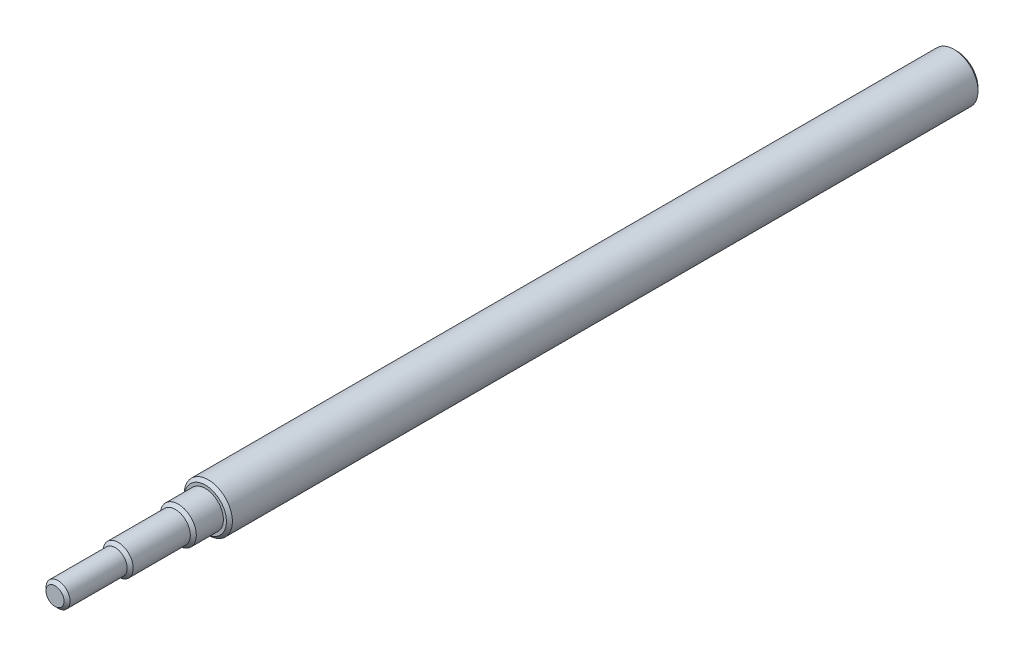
ISO-10303-21;
HEADER;
FILE_DESCRIPTION(('STEP AP214'),'2;1');
FILE_NAME('part.step','',(''),(''),'','','');
FILE_SCHEMA(('AUTOMOTIVE_DESIGN { 1 0 10303 214 1 1 1 1 }'));
ENDSEC;
DATA;
#1=APPLICATION_CONTEXT('core data for automotive mechanical design processes');
#2=APPLICATION_PROTOCOL_DEFINITION('international standard','automotive_design',2000,#1);
#3=PRODUCT_CONTEXT('',#1,'mechanical');
#4=PRODUCT('Part','Part','',(#3));
#5=PRODUCT_RELATED_PRODUCT_CATEGORY('part','',(#4));
#6=PRODUCT_DEFINITION_FORMATION('','',#4);
#7=PRODUCT_DEFINITION_CONTEXT('part definition',#1,'design');
#8=PRODUCT_DEFINITION('design','',#6,#7);
#9=PRODUCT_DEFINITION_SHAPE('','',#8);
#10=(LENGTH_UNIT() NAMED_UNIT(*) SI_UNIT(.MILLI.,.METRE.));
#11=(NAMED_UNIT(*) PLANE_ANGLE_UNIT() SI_UNIT($,.RADIAN.));
#12=(NAMED_UNIT(*) SI_UNIT($,.STERADIAN.) SOLID_ANGLE_UNIT());
#13=UNCERTAINTY_MEASURE_WITH_UNIT(LENGTH_MEASURE(1.E-05),#10,'distance_accuracy_value','');
#14=(GEOMETRIC_REPRESENTATION_CONTEXT(3) GLOBAL_UNCERTAINTY_ASSIGNED_CONTEXT((#13)) GLOBAL_UNIT_ASSIGNED_CONTEXT((#10,
#11,#12)) REPRESENTATION_CONTEXT('',''));
#15=CARTESIAN_POINT('',(0.,0.,0.));
#16=DIRECTION('',(0.,0.,1.));
#17=DIRECTION('',(1.,0.,0.));
#18=AXIS2_PLACEMENT_3D('',#15,#16,#17);
#19=CARTESIAN_POINT('',(0.,0.,250.));
#20=DIRECTION('',(0.,0.,-1.));
#21=DIRECTION('',(-1.,0.,0.));
#22=AXIS2_PLACEMENT_3D('',#19,#20,#21);
#23=CYLINDRICAL_SURFACE('',#22,8.);
#24=CARTESIAN_POINT('',(0.,0.,249.));
#25=DIRECTION('',(0.,0.,1.));
#26=DIRECTION('',(1.,0.,0.));
#27=AXIS2_PLACEMENT_3D('',#24,#25,#26);
#28=CIRCLE('',#27,8.);
#29=CARTESIAN_POINT('',(8.,0.,249.));
#30=VERTEX_POINT('',#29);
#31=EDGE_CURVE('E55',#30,#30,#28,.F.);
#32=ORIENTED_EDGE('',*,*,#31,.T.);
#33=EDGE_LOOP('',(#32));
#34=FACE_BOUND('',#33,.T.);
#35=CARTESIAN_POINT('',(0.,0.,0.999999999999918));
#36=DIRECTION('',(0.,0.,1.));
#37=DIRECTION('',(1.,0.,0.));
#38=AXIS2_PLACEMENT_3D('',#35,#36,#37);
#39=CIRCLE('',#38,8.);
#40=CARTESIAN_POINT('',(8.,0.,0.999999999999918));
#41=VERTEX_POINT('',#40);
#42=EDGE_CURVE('E64',#41,#41,#39,.T.);
#43=ORIENTED_EDGE('',*,*,#42,.T.);
#44=EDGE_LOOP('',(#43));
#45=FACE_BOUND('',#44,.T.);
#46=ADVANCED_FACE('F35',(#34,#45),#23,.T.);
#47=CARTESIAN_POINT('',(0.,0.,250.));
#48=DIRECTION('',(0.,0.,1.));
#49=DIRECTION('',(1.,0.,0.));
#50=AXIS2_PLACEMENT_3D('',#47,#48,#49);
#51=PLANE('',#50);
#52=CARTESIAN_POINT('',(0.,0.,250.));
#53=DIRECTION('',(0.,0.,1.));
#54=DIRECTION('',(1.,0.,0.));
#55=AXIS2_PLACEMENT_3D('',#52,#53,#54);
#56=CIRCLE('',#55,7.00000000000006);
#57=CARTESIAN_POINT('',(7.00000000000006,0.,250.));
#58=VERTEX_POINT('',#57);
#59=EDGE_CURVE('E58',#58,#58,#56,.T.);
#60=ORIENTED_EDGE('',*,*,#59,.T.);
#61=EDGE_LOOP('',(#60));
#62=FACE_BOUND('',#61,.T.);
#63=CARTESIAN_POINT('',(0.,0.,250.));
#64=DIRECTION('',(0.,0.,1.));
#65=DIRECTION('',(1.,0.,0.));
#66=AXIS2_PLACEMENT_3D('',#63,#64,#65);
#67=CIRCLE('',#66,6.);
#68=CARTESIAN_POINT('',(6.,0.,250.));
#69=VERTEX_POINT('',#68);
#70=EDGE_CURVE('E67',#69,#69,#67,.T.);
#71=ORIENTED_EDGE('',*,*,#70,.F.);
#72=EDGE_LOOP('',(#71));
#73=FACE_BOUND('',#72,.T.);
#74=ADVANCED_FACE('F92',(#62,#73),#51,.T.);
#75=CARTESIAN_POINT('',(0.,0.,0.));
#76=DIRECTION('',(0.,0.,1.));
#77=DIRECTION('',(1.,0.,0.));
#78=AXIS2_PLACEMENT_3D('',#75,#76,#77);
#79=PLANE('',#78);
#80=CARTESIAN_POINT('',(0.,0.,0.));
#81=DIRECTION('',(0.,0.,1.));
#82=DIRECTION('',(1.,0.,0.));
#83=AXIS2_PLACEMENT_3D('',#80,#81,#82);
#84=CIRCLE('',#83,7.00000000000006);
#85=CARTESIAN_POINT('',(7.00000000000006,0.,0.));
#86=VERTEX_POINT('',#85);
#87=EDGE_CURVE('E61',#86,#86,#84,.F.);
#88=ORIENTED_EDGE('',*,*,#87,.T.);
#89=EDGE_LOOP('',(#88));
#90=FACE_BOUND('',#89,.T.);
#91=ADVANCED_FACE('F98',(#90),#79,.F.);
#92=CARTESIAN_POINT('',(0.,0.,260.));
#93=DIRECTION('',(0.,0.,-1.));
#94=DIRECTION('',(-1.,0.,0.));
#95=AXIS2_PLACEMENT_3D('',#92,#93,#94);
#96=CYLINDRICAL_SURFACE('',#95,6.);
#97=CARTESIAN_POINT('',(0.,0.,259.));
#98=DIRECTION('',(0.,0.,1.));
#99=DIRECTION('',(1.,0.,0.));
#100=AXIS2_PLACEMENT_3D('',#97,#98,#99);
#101=CIRCLE('',#100,6.);
#102=CARTESIAN_POINT('',(6.,0.,259.));
#103=VERTEX_POINT('',#102);
#104=EDGE_CURVE('E10',#103,#103,#101,.F.);
#105=ORIENTED_EDGE('',*,*,#104,.T.);
#106=EDGE_LOOP('',(#105));
#107=FACE_BOUND('',#106,.T.);
#108=ORIENTED_EDGE('',*,*,#70,.T.);
#109=EDGE_LOOP('',(#108));
#110=FACE_BOUND('',#109,.T.);
#111=ADVANCED_FACE('F119',(#107,#110),#96,.T.);
#112=CARTESIAN_POINT('',(0.,0.,280.));
#113=DIRECTION('',(0.,0.,-1.));
#114=DIRECTION('',(-1.,0.,0.));
#115=AXIS2_PLACEMENT_3D('',#112,#113,#114);
#116=CYLINDRICAL_SURFACE('',#115,5.);
#117=CARTESIAN_POINT('',(0.,0.,279.));
#118=DIRECTION('',(0.,0.,1.));
#119=DIRECTION('',(1.,0.,0.));
#120=AXIS2_PLACEMENT_3D('',#117,#118,#119);
#121=CIRCLE('',#120,5.);
#122=CARTESIAN_POINT('',(5.,0.,279.));
#123=VERTEX_POINT('',#122);
#124=EDGE_CURVE('E42',#123,#123,#121,.F.);
#125=ORIENTED_EDGE('',*,*,#124,.T.);
#126=EDGE_LOOP('',(#125));
#127=FACE_BOUND('',#126,.T.);
#128=CARTESIAN_POINT('',(0.,0.,260.));
#129=DIRECTION('',(0.,0.,1.));
#130=DIRECTION('',(1.,0.,0.));
#131=AXIS2_PLACEMENT_3D('',#128,#129,#130);
#132=CIRCLE('',#131,5.);
#133=CARTESIAN_POINT('',(5.,0.,260.));
#134=VERTEX_POINT('',#133);
#135=EDGE_CURVE('E70',#134,#134,#132,.T.);
#136=ORIENTED_EDGE('',*,*,#135,.T.);
#137=EDGE_LOOP('',(#136));
#138=FACE_BOUND('',#137,.T.);
#139=ADVANCED_FACE('F121',(#127,#138),#116,.T.);
#140=CARTESIAN_POINT('',(0.,0.,300.));
#141=DIRECTION('',(0.,0.,-1.));
#142=DIRECTION('',(-1.,0.,0.));
#143=AXIS2_PLACEMENT_3D('',#140,#141,#142);
#144=CYLINDRICAL_SURFACE('',#143,4.);
#145=CARTESIAN_POINT('',(0.,0.,299.));
#146=DIRECTION('',(0.,0.,1.));
#147=DIRECTION('',(1.,0.,0.));
#148=AXIS2_PLACEMENT_3D('',#145,#146,#147);
#149=CIRCLE('',#148,4.);
#150=CARTESIAN_POINT('',(4.,0.,299.));
#151=VERTEX_POINT('',#150);
#152=EDGE_CURVE('E46',#151,#151,#149,.F.);
#153=ORIENTED_EDGE('',*,*,#152,.T.);
#154=EDGE_LOOP('',(#153));
#155=FACE_BOUND('',#154,.T.);
#156=CARTESIAN_POINT('',(0.,0.,280.));
#157=DIRECTION('',(0.,0.,1.));
#158=DIRECTION('',(1.,0.,0.));
#159=AXIS2_PLACEMENT_3D('',#156,#157,#158);
#160=CIRCLE('',#159,4.);
#161=CARTESIAN_POINT('',(4.,0.,280.));
#162=VERTEX_POINT('',#161);
#163=EDGE_CURVE('E73',#162,#162,#160,.T.);
#164=ORIENTED_EDGE('',*,*,#163,.T.);
#165=EDGE_LOOP('',(#164));
#166=FACE_BOUND('',#165,.T.);
#167=ADVANCED_FACE('F77',(#155,#166),#144,.T.);
#168=CARTESIAN_POINT('',(0.,0.,300.));
#169=DIRECTION('',(0.,0.,1.));
#170=DIRECTION('',(1.,0.,0.));
#171=AXIS2_PLACEMENT_3D('',#168,#169,#170);
#172=PLANE('',#171);
#173=CARTESIAN_POINT('',(0.,0.,300.));
#174=DIRECTION('',(0.,0.,1.));
#175=DIRECTION('',(1.,0.,0.));
#176=AXIS2_PLACEMENT_3D('',#173,#174,#175);
#177=CIRCLE('',#176,3.00000000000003);
#178=CARTESIAN_POINT('',(3.00000000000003,0.,300.));
#179=VERTEX_POINT('',#178);
#180=EDGE_CURVE('E50',#179,#179,#177,.T.);
#181=ORIENTED_EDGE('',*,*,#180,.T.);
#182=EDGE_LOOP('',(#181));
#183=FACE_BOUND('',#182,.T.);
#184=ADVANCED_FACE('F107',(#183),#172,.T.);
#185=CARTESIAN_POINT('',(0.,0.,0.999999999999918));
#186=DIRECTION('',(0.,0.,1.));
#187=DIRECTION('',(1.,0.,0.));
#188=AXIS2_PLACEMENT_3D('',#185,#186,#187);
#189=CONICAL_SURFACE('',#188,8.,0.785398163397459);
#190=ORIENTED_EDGE('',*,*,#87,.F.);
#191=EDGE_LOOP('',(#190));
#192=FACE_BOUND('',#191,.T.);
#193=ORIENTED_EDGE('',*,*,#42,.F.);
#194=EDGE_LOOP('',(#193));
#195=FACE_BOUND('',#194,.T.);
#196=ADVANCED_FACE('F104',(#192,#195),#189,.T.);
#197=CARTESIAN_POINT('',(0.,0.,250.));
#198=DIRECTION('',(0.,0.,-1.));
#199=DIRECTION('',(-1.,0.,0.));
#200=AXIS2_PLACEMENT_3D('',#197,#198,#199);
#201=CONICAL_SURFACE('',#200,7.00000000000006,0.785398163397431);
#202=ORIENTED_EDGE('',*,*,#31,.F.);
#203=EDGE_LOOP('',(#202));
#204=FACE_BOUND('',#203,.T.);
#205=ORIENTED_EDGE('',*,*,#59,.F.);
#206=EDGE_LOOP('',(#205));
#207=FACE_BOUND('',#206,.T.);
#208=ADVANCED_FACE('F88',(#204,#207),#201,.T.);
#209=CARTESIAN_POINT('',(0.,0.,300.));
#210=DIRECTION('',(0.,0.,-1.));
#211=DIRECTION('',(-1.,0.,0.));
#212=AXIS2_PLACEMENT_3D('',#209,#210,#211);
#213=CONICAL_SURFACE('',#212,3.00000000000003,0.785398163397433);
#214=ORIENTED_EDGE('',*,*,#152,.F.);
#215=EDGE_LOOP('',(#214));
#216=FACE_BOUND('',#215,.T.);
#217=ORIENTED_EDGE('',*,*,#180,.F.);
#218=EDGE_LOOP('',(#217));
#219=FACE_BOUND('',#218,.T.);
#220=ADVANCED_FACE('F81',(#216,#219),#213,.T.);
#221=CARTESIAN_POINT('',(0.,0.,280.));
#222=DIRECTION('',(0.,0.,-1.));
#223=DIRECTION('',(-1.,0.,0.));
#224=AXIS2_PLACEMENT_3D('',#221,#222,#223);
#225=CONICAL_SURFACE('',#224,3.99999999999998,0.78539816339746);
#226=ORIENTED_EDGE('',*,*,#124,.F.);
#227=EDGE_LOOP('',(#226));
#228=FACE_BOUND('',#227,.T.);
#229=ORIENTED_EDGE('',*,*,#163,.F.);
#230=EDGE_LOOP('',(#229));
#231=FACE_BOUND('',#230,.T.);
#232=ADVANCED_FACE('F79',(#228,#231),#225,.T.);
#233=CARTESIAN_POINT('',(0.,0.,260.));
#234=DIRECTION('',(0.,0.,-1.));
#235=DIRECTION('',(-1.,0.,0.));
#236=AXIS2_PLACEMENT_3D('',#233,#234,#235);
#237=CONICAL_SURFACE('',#236,4.99999999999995,0.785398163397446);
#238=ORIENTED_EDGE('',*,*,#104,.F.);
#239=EDGE_LOOP('',(#238));
#240=FACE_BOUND('',#239,.T.);
#241=ORIENTED_EDGE('',*,*,#135,.F.);
#242=EDGE_LOOP('',(#241));
#243=FACE_BOUND('',#242,.T.);
#244=ADVANCED_FACE('F37',(#240,#243),#237,.T.);
#245=CLOSED_SHELL('',(#46,#74,#91,#111,#139,#167,#184,#196,#208,#220,#232,#244));
#246=MANIFOLD_SOLID_BREP('B2',#245);
#247=ADVANCED_BREP_SHAPE_REPRESENTATION('',(#18,#246),#14);
#248=SHAPE_DEFINITION_REPRESENTATION(#9,#247);
ENDSEC;
END-ISO-10303-21;
